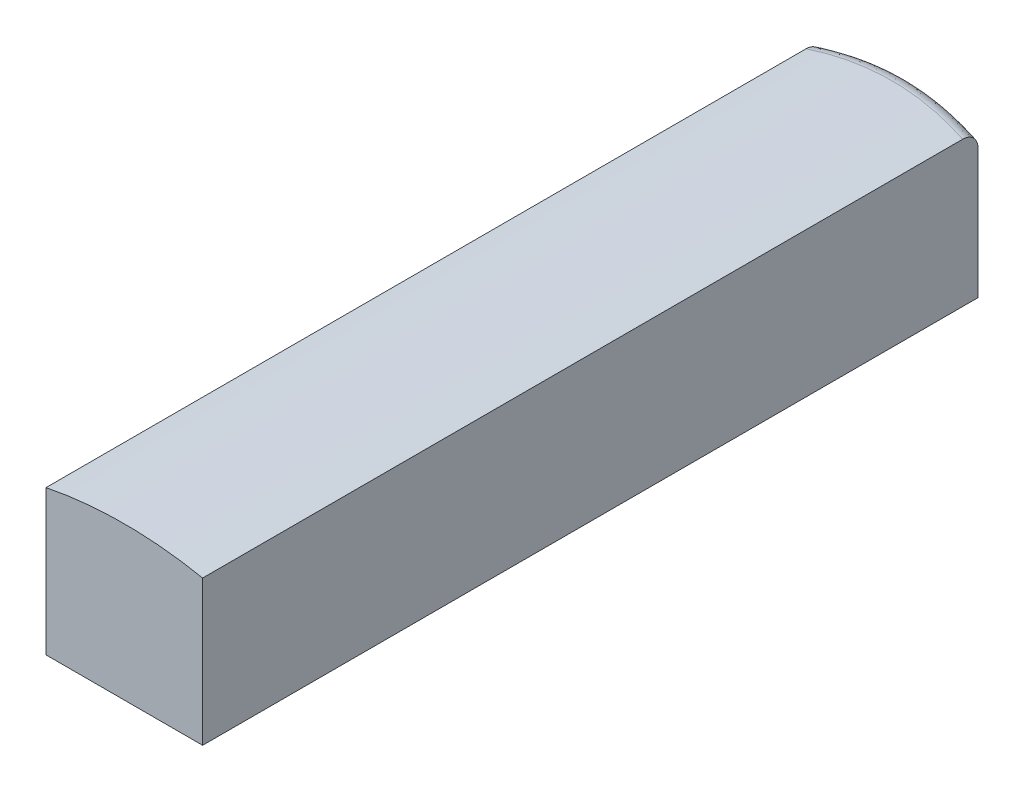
ISO-10303-21;
HEADER;
FILE_DESCRIPTION(('STEP AP214'),'2;1');
FILE_NAME('part.step','',(''),(''),'','','');
FILE_SCHEMA(('AUTOMOTIVE_DESIGN { 1 0 10303 214 1 1 1 1 }'));
ENDSEC;
DATA;
#1=APPLICATION_CONTEXT('core data for automotive mechanical design processes');
#2=APPLICATION_PROTOCOL_DEFINITION('international standard','automotive_design',2000,#1);
#3=PRODUCT_CONTEXT('',#1,'mechanical');
#4=PRODUCT('Part','Part','',(#3));
#5=PRODUCT_RELATED_PRODUCT_CATEGORY('part','',(#4));
#6=PRODUCT_DEFINITION_FORMATION('','',#4);
#7=PRODUCT_DEFINITION_CONTEXT('part definition',#1,'design');
#8=PRODUCT_DEFINITION('design','',#6,#7);
#9=PRODUCT_DEFINITION_SHAPE('','',#8);
#10=(LENGTH_UNIT() NAMED_UNIT(*) SI_UNIT(.MILLI.,.METRE.));
#11=(NAMED_UNIT(*) PLANE_ANGLE_UNIT() SI_UNIT($,.RADIAN.));
#12=(NAMED_UNIT(*) SI_UNIT($,.STERADIAN.) SOLID_ANGLE_UNIT());
#13=UNCERTAINTY_MEASURE_WITH_UNIT(LENGTH_MEASURE(1.E-05),#10,'distance_accuracy_value','');
#14=(GEOMETRIC_REPRESENTATION_CONTEXT(3) GLOBAL_UNCERTAINTY_ASSIGNED_CONTEXT((#13)) GLOBAL_UNIT_ASSIGNED_CONTEXT((#10,
#11,#12)) REPRESENTATION_CONTEXT('',''));
#15=CARTESIAN_POINT('',(0.,0.,0.));
#16=DIRECTION('',(0.,0.,1.));
#17=DIRECTION('',(1.,0.,0.));
#18=AXIS2_PLACEMENT_3D('',#15,#16,#17);
#19=CARTESIAN_POINT('',(0.,-309.999999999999,0.));
#20=DIRECTION('',(0.,0.,-1.));
#21=DIRECTION('',(-1.,0.,0.));
#22=AXIS2_PLACEMENT_3D('',#19,#20,#21);
#23=PLANE('',#22);
#24=DIRECTION('',(1.,0.,0.));
#25=VECTOR('',#24,1.);
#26=CARTESIAN_POINT('',(-100.,0.,0.));
#27=LINE('',#26,#25);
#28=CARTESIAN_POINT('',(-100.,0.,0.));
#29=VERTEX_POINT('',#28);
#30=CARTESIAN_POINT('',(100.,0.,0.));
#31=VERTEX_POINT('',#30);
#32=EDGE_CURVE('E85',#29,#31,#27,.T.);
#33=ORIENTED_EDGE('',*,*,#32,.T.);
#34=DIRECTION('',(0.,1.,0.));
#35=VECTOR('',#34,1.);
#36=CARTESIAN_POINT('',(100.,0.,0.));
#37=LINE('',#36,#35);
#38=CARTESIAN_POINT('',(100.,185.,0.));
#39=VERTEX_POINT('',#38);
#40=EDGE_CURVE('E94',#31,#39,#37,.T.);
#41=ORIENTED_EDGE('',*,*,#40,.T.);
#42=CARTESIAN_POINT('',(0.,-309.999999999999,0.));
#43=DIRECTION('',(0.,0.,1.));
#44=DIRECTION('',(-1.,0.,0.));
#45=AXIS2_PLACEMENT_3D('',#42,#43,#44);
#46=CIRCLE('',#45,504.999999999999);
#47=CARTESIAN_POINT('',(-100.,185.,0.));
#48=VERTEX_POINT('',#47);
#49=EDGE_CURVE('E100',#39,#48,#46,.T.);
#50=ORIENTED_EDGE('',*,*,#49,.T.);
#51=DIRECTION('',(0.,-1.,0.));
#52=VECTOR('',#51,1.);
#53=CARTESIAN_POINT('',(-100.,185.,0.));
#54=LINE('',#53,#52);
#55=EDGE_CURVE('E91',#48,#29,#54,.T.);
#56=ORIENTED_EDGE('',*,*,#55,.T.);
#57=EDGE_LOOP('',(#33,#41,#50,#56));
#58=FACE_BOUND('',#57,.T.);
#59=ADVANCED_FACE('F31',(#58),#23,.F.);
#60=CARTESIAN_POINT('',(100.,0.,-1000.001));
#61=DIRECTION('',(1.,0.,0.));
#62=DIRECTION('',(0.,0.,-1.));
#63=AXIS2_PLACEMENT_3D('',#60,#61,#62);
#64=PLANE('',#63);
#65=DIRECTION('',(0.,-1.,0.));
#66=VECTOR('',#65,1.);
#67=CARTESIAN_POINT('',(100.,200.,-990.));
#68=LINE('',#67,#66);
#69=CARTESIAN_POINT('',(100.,0.,-990.));
#70=VERTEX_POINT('',#69);
#71=CARTESIAN_POINT('',(100.,165.39603960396,-990.));
#72=VERTEX_POINT('',#71);
#73=EDGE_CURVE('E111',#70,#72,#68,.F.);
#74=ORIENTED_EDGE('',*,*,#73,.T.);
#75=CARTESIAN_POINT('',(505.,-309.999999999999,-495.));
#76=CARTESIAN_POINT('',(505.,-309.999999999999,-495.));
#77=CARTESIAN_POINT('',(504.999999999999,-309.999999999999,-495.));
#78=CARTESIAN_POINT('',(504.999964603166,-304.717241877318,-500.500603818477));
#79=CARTESIAN_POINT('',(505.000059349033,-304.608315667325,-500.391684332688));
#80=CARTESIAN_POINT('',(504.999964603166,-304.499396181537,-500.282758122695));
#81=CARTESIAN_POINT('',(504.910127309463,-299.434492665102,-506.001198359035));
#82=CARTESIAN_POINT('',(504.913681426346,-299.215686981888,-505.784313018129));
#83=CARTESIAN_POINT('',(504.910127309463,-298.998801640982,-505.565507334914));
#84=CARTESIAN_POINT('',(504.550597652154,-288.871786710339,-516.999479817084));
#85=CARTESIAN_POINT('',(504.568333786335,-288.434845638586,-516.565154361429));
#86=CARTESIAN_POINT('',(504.550597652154,-288.000520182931,-516.128213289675));
#87=CARTESIAN_POINT('',(504.280904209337,-283.591829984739,-522.497166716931));
#88=CARTESIAN_POINT('',(504.309240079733,-283.044715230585,-521.955284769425));
#89=CARTESIAN_POINT('',(504.280904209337,-282.50283328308,-521.408170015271));
#90=CARTESIAN_POINT('',(503.561381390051,-273.037113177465,-533.487129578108));
#91=CARTESIAN_POINT('',(503.618161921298,-272.270976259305,-532.729023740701));
#92=CARTESIAN_POINT('',(503.561381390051,-271.512870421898,-531.962886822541));
#93=CARTESIAN_POINT('',(503.11153720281,-267.762353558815,-538.979405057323));
#94=CARTESIAN_POINT('',(503.185916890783,-266.885454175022,-538.114545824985));
#95=CARTESIAN_POINT('',(503.11153720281,-266.020594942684,-537.237646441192));
#96=CARTESIAN_POINT('',(502.031236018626,-257.221489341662,-549.954944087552));
#97=CARTESIAN_POINT('',(502.148201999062,-256.124093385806,-548.875906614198));
#98=CARTESIAN_POINT('',(502.031236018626,-255.045055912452,-547.778510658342));
#99=CARTESIAN_POINT('',(501.400779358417,-251.955384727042,-555.43820765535));
#100=CARTESIAN_POINT('',(501.542362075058,-250.746347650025,-554.253652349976));
#101=CARTESIAN_POINT('',(501.400779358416,-249.561792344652,-553.044615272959));
#102=CARTESIAN_POINT('',(499.2497910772,-236.263967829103,-571.776693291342));
#103=CARTESIAN_POINT('',(499.47429734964,-234.711758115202,-570.288241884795));
#104=CARTESIAN_POINT('',(499.249791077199,-233.223306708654,-568.736032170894));
#105=CARTESIAN_POINT('',(497.463458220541,-225.854828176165,-582.615075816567));
#106=CARTESIAN_POINT('',(497.755478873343,-224.072252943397,-580.927747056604));
#107=CARTESIAN_POINT('',(497.463458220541,-222.384924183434,-579.145171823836));
#108=CARTESIAN_POINT('',(493.170701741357,-205.105754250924,-604.219781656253));
#109=CARTESIAN_POINT('',(493.629382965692,-202.87010914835,-602.129890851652));
#110=CARTESIAN_POINT('',(493.170701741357,-200.78021834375,-599.894245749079));
#111=CARTESIAN_POINT('',(490.664294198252,-194.76581843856,-614.986106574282));
#112=CARTESIAN_POINT('',(491.216283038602,-192.29290073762,-612.70709926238));
#113=CARTESIAN_POINT('',(490.664294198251,-190.013893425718,-610.23418156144));
#114=CARTESIAN_POINT('',(484.968865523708,-174.352020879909,-636.241710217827));
#115=CARTESIAN_POINT('',(485.738546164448,-171.414268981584,-633.585731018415));
#116=CARTESIAN_POINT('',(484.968865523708,-168.758289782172,-630.64797912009));
#117=CARTESIAN_POINT('',(481.791974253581,-164.276602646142,-646.732609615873));
#118=CARTESIAN_POINT('',(482.677698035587,-161.09659085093,-643.903409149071));
#119=CARTESIAN_POINT('',(481.791974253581,-158.267390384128,-640.723397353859));
#120=CARTESIAN_POINT('',(474.718918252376,-144.242645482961,-667.592709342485));
#121=CARTESIAN_POINT('',(475.868624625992,-140.579524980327,-664.420475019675));
#122=CARTESIAN_POINT('',(474.718918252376,-137.407290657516,-660.75735451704));
#123=CARTESIAN_POINT('',(470.822756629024,-134.284106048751,-677.961910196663));
#124=CARTESIAN_POINT('',(472.110958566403,-130.367104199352,-674.632895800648));
#125=CARTESIAN_POINT('',(470.822756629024,-127.038089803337,-670.715893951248));
#126=CARTESIAN_POINT('',(462.400437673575,-114.75610806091,-698.295186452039));
#127=CARTESIAN_POINT('',(463.99447354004,-110.337740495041,-694.662259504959));
#128=CARTESIAN_POINT('',(462.400437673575,-106.70481354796,-690.243891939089));
#129=CARTESIAN_POINT('',(457.892132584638,-105.183104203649,-708.262953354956));
#130=CARTESIAN_POINT('',(459.64112101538,-100.503614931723,-704.496385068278));
#131=CARTESIAN_POINT('',(457.892132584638,-96.7370466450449,-699.816895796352));
#132=CARTESIAN_POINT('',(448.159370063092,-86.2061475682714,-728.022464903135));
#133=CARTESIAN_POINT('',(450.247392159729,-80.9988131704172,-724.001186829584));
#134=CARTESIAN_POINT('',(448.159370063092,-76.9775350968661,-718.793852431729));
#135=CARTESIAN_POINT('',(442.934921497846,-76.8021926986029,-737.814211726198));
#136=CARTESIAN_POINT('',(445.194491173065,-71.3174949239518,-733.682505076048));
#137=CARTESIAN_POINT('',(442.934921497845,-67.1857882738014,-728.197807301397));
#138=CARTESIAN_POINT('',(431.928407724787,-58.4933556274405,-756.878052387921));
#139=CARTESIAN_POINT('',(434.554275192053,-52.4567042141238,-752.543295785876));
#140=CARTESIAN_POINT('',(431.928407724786,-48.1219476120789,-746.506644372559));
#141=CARTESIAN_POINT('',(426.169332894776,-49.5821097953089,-766.156772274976));
#142=CARTESIAN_POINT('',(428.973948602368,-43.2591098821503,-761.74089011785));
#143=CARTESIAN_POINT('',(426.169332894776,-38.8432277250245,-755.417890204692));
#144=CARTESIAN_POINT('',(413.942728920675,-31.9861534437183,-784.478335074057));
#145=CARTESIAN_POINT('',(417.126922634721,-25.0774650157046,-779.922534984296));
#146=CARTESIAN_POINT('',(413.942728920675,-20.5216649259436,-773.013846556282));
#147=CARTESIAN_POINT('',(407.475211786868,-23.3014390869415,-793.52118198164));
#148=CARTESIAN_POINT('',(410.845517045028,-16.086089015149,-788.91391098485));
#149=CARTESIAN_POINT('',(407.475211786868,-11.4788180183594,-781.698560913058));
#150=CARTESIAN_POINT('',(394.070679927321,-6.52416486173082,-810.990302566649));
#151=CARTESIAN_POINT('',(397.826393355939,1.30530398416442,-806.305303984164));
#152=CARTESIAN_POINT('',(394.07067992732,5.99030256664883,-798.475835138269));
#153=CARTESIAN_POINT('',(387.160762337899,1.57836194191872,-819.426954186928));
#154=CARTESIAN_POINT('',(391.097195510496,9.72406397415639,-814.724063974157));
#155=CARTESIAN_POINT('',(387.160762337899,14.4269541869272,-806.578361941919));
#156=CARTESIAN_POINT('',(372.648440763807,17.4928438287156,-835.997703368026));
#157=CARTESIAN_POINT('',(376.955513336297,26.2907131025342,-831.290713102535));
#158=CARTESIAN_POINT('',(372.648440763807,30.997703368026,-822.492843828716));
#159=CARTESIAN_POINT('',(365.046053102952,25.304805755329,-844.131808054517));
#160=CARTESIAN_POINT('',(369.527623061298,34.441675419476,-839.441675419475));
#161=CARTESIAN_POINT('',(365.046053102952,39.1318080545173,-830.304805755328));
#162=CARTESIAN_POINT('',(349.469942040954,40.2640182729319,-859.707895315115));
#163=CARTESIAN_POINT('',(354.29827024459,50.0821909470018,-855.082190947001));
#164=CARTESIAN_POINT('',(349.469942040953,54.7078953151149,-845.264018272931));
#165=CARTESIAN_POINT('',(341.525728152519,47.4254087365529,-867.164600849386));
#166=CARTESIAN_POINT('',(346.507188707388,57.5904228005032,-862.590422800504));
#167=CARTESIAN_POINT('',(341.525728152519,62.1646008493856,-852.425408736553));
#168=CARTESIAN_POINT('',(324.974515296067,61.3863780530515,-881.70128024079));
#169=CARTESIAN_POINT('',(330.251426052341,72.2687100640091,-877.268710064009));
#170=CARTESIAN_POINT('',(324.974515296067,76.7012802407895,-866.386378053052));
#171=CARTESIAN_POINT('',(316.367537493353,68.1859684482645,-888.781266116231));
#172=CARTESIAN_POINT('',(321.772912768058,79.4368073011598,-884.436807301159));
#173=CARTESIAN_POINT('',(316.367537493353,83.7812661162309,-873.185968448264));
#174=CARTESIAN_POINT('',(298.882265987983,81.0714383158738,-902.198095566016));
#175=CARTESIAN_POINT('',(304.52129178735,93.0619812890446,-898.061981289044));
#176=CARTESIAN_POINT('',(298.882265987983,97.1980955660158,-886.071438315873));
#177=CARTESIAN_POINT('',(290.033414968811,87.1756463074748,-908.55402347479));
#178=CARTESIAN_POINT('',(295.761208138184,99.5366714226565,-904.536671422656));
#179=CARTESIAN_POINT('',(290.03341496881,103.55402347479,-892.175646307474));
#180=CARTESIAN_POINT('',(276.301948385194,96.0017671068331,-917.744108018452));
#181=CARTESIAN_POINT('',(282.187103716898,108.898385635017,-913.898385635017));
#182=CARTESIAN_POINT('',(276.301948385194,112.744108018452,-901.001767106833));
#183=CARTESIAN_POINT('',(271.648017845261,98.88900406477,-920.750406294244));
#184=CARTESIAN_POINT('',(277.561860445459,111.977467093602,-916.977467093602));
#185=CARTESIAN_POINT('',(271.648017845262,115.750406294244,-903.88900406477));
#186=CARTESIAN_POINT('',(262.187882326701,104.545863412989,-926.640538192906));
#187=CARTESIAN_POINT('',(268.146372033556,118.02213233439,-923.02213233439));
#188=CARTESIAN_POINT('',(262.187882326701,121.640538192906,-909.545863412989));
#189=CARTESIAN_POINT('',(257.381690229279,107.315495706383,-929.524382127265));
#190=CARTESIAN_POINT('',(263.355187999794,120.986626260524,-925.986626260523));
#191=CARTESIAN_POINT('',(257.381690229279,124.524382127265,-912.315495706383));
#192=CARTESIAN_POINT('',(247.832681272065,112.610280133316,-935.037508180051));
#193=CARTESIAN_POINT('',(253.822779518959,126.664818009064,-931.664818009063));
#194=CARTESIAN_POINT('',(247.832681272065,130.037508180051,-917.610280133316));
#195=CARTESIAN_POINT('',(243.096349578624,115.1408272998,-937.67240780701));
#196=CARTESIAN_POINT('',(249.086422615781,129.383569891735,-934.383569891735));
#197=CARTESIAN_POINT('',(243.096349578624,132.67240780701,-920.1408272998));
#198=CARTESIAN_POINT('',(233.487827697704,120.079589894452,-942.814830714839));
#199=CARTESIAN_POINT('',(239.462557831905,134.700779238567,-939.700779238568));
#200=CARTESIAN_POINT('',(233.487827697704,137.814830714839,-925.079589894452));
#201=CARTESIAN_POINT('',(228.615649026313,122.487815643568,-945.322364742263));
#202=CARTESIAN_POINT('',(234.574689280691,137.297945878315,-942.297945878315));
#203=CARTESIAN_POINT('',(228.615649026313,140.322364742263,-927.487815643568));
#204=CARTESIAN_POINT('',(218.737606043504,127.17456394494,-950.202381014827));
#205=CARTESIAN_POINT('',(224.64818140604,142.363479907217,-947.363479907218));
#206=CARTESIAN_POINT('',(218.737606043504,145.202381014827,-932.17456394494));
#207=CARTESIAN_POINT('',(213.731739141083,129.453083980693,-952.57486063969));
#208=CARTESIAN_POINT('',(219.609465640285,144.83038132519,-949.83038132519));
#209=CARTESIAN_POINT('',(213.731739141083,147.57486063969,-934.453083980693));
#210=CARTESIAN_POINT('',(203.589897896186,133.872525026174,-957.176546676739));
#211=CARTESIAN_POINT('',(209.383115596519,149.62608424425,-954.62608424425));
#212=CARTESIAN_POINT('',(203.589897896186,152.176546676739,-938.872525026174));
#213=CARTESIAN_POINT('',(198.453924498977,136.013447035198,-959.405754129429));
#214=CARTESIAN_POINT('',(204.195754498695,151.953274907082,-956.953274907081));
#215=CARTESIAN_POINT('',(198.453924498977,154.405754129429,-941.013447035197));
#216=CARTESIAN_POINT('',(188.259991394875,140.068686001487,-963.628219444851));
#217=CARTESIAN_POINT('',(193.882445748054,156.371035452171,-961.37103545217));
#218=CARTESIAN_POINT('',(188.259991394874,158.628219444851,-945.068686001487));
#219=CARTESIAN_POINT('',(183.206856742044,141.988594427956,-965.627299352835));
#220=CARTESIAN_POINT('',(188.761325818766,158.466297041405,-963.466297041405));
#221=CARTESIAN_POINT('',(183.206856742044,160.627299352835,-946.988594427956));
#222=CARTESIAN_POINT('',(172.989532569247,145.686845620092,-969.478055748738));
#223=CARTESIAN_POINT('',(178.38801484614,162.511481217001,-967.511481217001));
#224=CARTESIAN_POINT('',(172.989532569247,164.478055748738,-950.686845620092));
#225=CARTESIAN_POINT('',(167.825345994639,147.465192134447,-971.32973613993));
#226=CARTESIAN_POINT('',(173.136802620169,164.459772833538,-969.459772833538));
#227=CARTESIAN_POINT('',(167.825345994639,166.32973613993,-952.465192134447));
#228=CARTESIAN_POINT('',(157.391699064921,150.873251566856,-974.878334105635));
#229=CARTESIAN_POINT('',(162.50816807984,168.202027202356,-973.202027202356));
#230=CARTESIAN_POINT('',(157.391699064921,169.878334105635,-955.873251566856));
#231=CARTESIAN_POINT('',(152.122240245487,152.502966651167,-976.575253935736));
#232=CARTESIAN_POINT('',(157.132141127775,169.994296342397,-974.994296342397));
#233=CARTESIAN_POINT('',(152.122240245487,171.575253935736,-957.502966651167));
#234=CARTESIAN_POINT('',(141.484822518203,155.606838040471,-979.807120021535));
#235=CARTESIAN_POINT('',(146.260085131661,173.415474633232,-978.415474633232));
#236=CARTESIAN_POINT('',(141.484822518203,174.807120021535,-960.606838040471));
#237=CARTESIAN_POINT('',(136.116864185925,157.08099525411,-981.342067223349));
#238=CARTESIAN_POINT('',(140.765897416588,175.04266365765,-980.04266365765));
#239=CARTESIAN_POINT('',(136.116864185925,176.342067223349,-962.080995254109));
#240=CARTESIAN_POINT('',(125.451984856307,159.825467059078,-984.199713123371));
#241=CARTESIAN_POINT('',(129.831864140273,178.078491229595,-983.078491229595));
#242=CARTESIAN_POINT('',(125.451984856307,179.199713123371,-964.825467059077));
#243=CARTESIAN_POINT('',(120.157727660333,161.100553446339,-985.527380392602));
#244=CARTESIAN_POINT('',(124.396608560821,179.490852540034,-984.490852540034));
#245=CARTESIAN_POINT('',(120.157727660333,180.527380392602,-966.100553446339));
#246=CARTESIAN_POINT('',(109.492101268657,163.492261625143,-988.017715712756));
#247=CARTESIAN_POINT('',(113.429028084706,182.145472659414,-987.145472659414));
#248=CARTESIAN_POINT('',(109.492101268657,183.017715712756,-968.492261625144));
#249=CARTESIAN_POINT('',(104.120732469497,164.608884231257,-989.180384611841));
#250=CARTESIAN_POINT('',(107.899228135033,183.386233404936,-988.386233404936));
#251=CARTESIAN_POINT('',(104.120732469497,184.180384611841,-969.608884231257));
#252=CARTESIAN_POINT('',(93.310076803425,166.678337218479,-991.335175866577));
#253=CARTESIAN_POINT('',(96.7526067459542,185.690188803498,-990.690188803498));
#254=CARTESIAN_POINT('',(93.3100768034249,186.335175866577,-971.678337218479));
#255=CARTESIAN_POINT('',(87.8707914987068,167.631171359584,-992.327302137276));
#256=CARTESIAN_POINT('',(91.1387206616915,186.751989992,-991.751989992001));
#257=CARTESIAN_POINT('',(87.8707914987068,187.327302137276,-972.631171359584));
#258=CARTESIAN_POINT('',(76.9341338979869,169.368345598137,-994.136112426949));
#259=CARTESIAN_POINT('',(79.8351269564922,188.691267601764,-993.691267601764));
#260=CARTESIAN_POINT('',(76.9341338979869,189.136112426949,-974.368345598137));
#261=CARTESIAN_POINT('',(71.4367617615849,170.152686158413,-994.952796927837));
#262=CARTESIAN_POINT('',(74.1487380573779,189.567493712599,-994.567493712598));
#263=CARTESIAN_POINT('',(71.4367617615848,189.952796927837,-975.152686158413));
#264=CARTESIAN_POINT('',(60.484692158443,171.537449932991,-996.394664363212));
#265=CARTESIAN_POINT('',(62.8062651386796,191.116904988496,-996.116904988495));
#266=CARTESIAN_POINT('',(60.4846921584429,191.394664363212,-976.53744993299));
#267=CARTESIAN_POINT('',(55.0307598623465,172.140662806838,-997.022751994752));
#268=CARTESIAN_POINT('',(57.1544578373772,191.792184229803,-996.792184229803));
#269=CARTESIAN_POINT('',(55.0307598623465,192.022751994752,-977.140662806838));
#270=CARTESIAN_POINT('',(44.0879509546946,173.17703172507,-998.101857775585));
#271=CARTESIAN_POINT('',(45.8029008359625,192.953928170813,-997.953928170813));
#272=CARTESIAN_POINT('',(44.0879509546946,193.101857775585,-978.17703172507));
#273=CARTESIAN_POINT('',(38.599074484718,173.610188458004,-998.55287664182));
#274=CARTESIAN_POINT('',(40.1069062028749,193.439600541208,-998.439600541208));
#275=CARTESIAN_POINT('',(38.599074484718,193.552876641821,-978.610188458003));
#276=CARTESIAN_POINT('',(27.5977785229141,174.304164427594,-999.275470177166));
#277=CARTESIAN_POINT('',(28.6810550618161,194.218575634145,-999.218575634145));
#278=CARTESIAN_POINT('',(27.5977785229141,194.275470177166,-979.304164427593));
#279=CARTESIAN_POINT('',(22.0853592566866,174.564985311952,-999.547046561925));
#280=CARTESIAN_POINT('',(22.9551565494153,194.511333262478,-999.511333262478));
#281=CARTESIAN_POINT('',(22.0853592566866,194.547046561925,-979.564985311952));
#282=CARTESIAN_POINT('',(11.048626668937,174.912903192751,-999.909311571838));
#283=CARTESIAN_POINT('',(11.484137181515,194.902185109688,-999.902185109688));
#284=CARTESIAN_POINT('',(11.048626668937,194.909311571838,-979.912903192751));
#285=CARTESIAN_POINT('',(5.52431333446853,175.,-1000.));
#286=CARTESIAN_POINT('',(5.74310031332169,195.,-999.999999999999));
#287=CARTESIAN_POINT('',(5.52431333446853,195.,-980.));
#288=CARTESIAN_POINT('',(-5.5243133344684,175.,-1000.));
#289=CARTESIAN_POINT('',(-5.74310031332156,195.,-999.999999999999));
#290=CARTESIAN_POINT('',(-5.5243133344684,195.,-980.));
#291=CARTESIAN_POINT('',(-11.0486266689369,174.912903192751,-999.909311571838));
#292=CARTESIAN_POINT('',(-11.4841371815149,194.902185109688,-999.902185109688));
#293=CARTESIAN_POINT('',(-11.0486266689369,194.909311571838,-979.912903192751));
#294=CARTESIAN_POINT('',(-22.0853592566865,174.564985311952,-999.547046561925));
#295=CARTESIAN_POINT('',(-22.9551565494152,194.511333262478,-999.511333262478));
#296=CARTESIAN_POINT('',(-22.0853592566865,194.547046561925,-979.564985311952));
#297=CARTESIAN_POINT('',(-27.597778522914,174.304164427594,-999.275470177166));
#298=CARTESIAN_POINT('',(-28.681055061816,194.218575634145,-999.218575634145));
#299=CARTESIAN_POINT('',(-27.597778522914,194.275470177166,-979.304164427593));
#300=CARTESIAN_POINT('',(-38.5990744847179,173.610188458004,-998.552876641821));
#301=CARTESIAN_POINT('',(-40.1069062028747,193.439600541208,-998.439600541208));
#302=CARTESIAN_POINT('',(-38.5990744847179,193.552876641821,-978.610188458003));
#303=CARTESIAN_POINT('',(-44.0879509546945,173.17703172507,-998.101857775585));
#304=CARTESIAN_POINT('',(-45.8029008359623,192.953928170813,-997.953928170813));
#305=CARTESIAN_POINT('',(-44.0879509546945,193.101857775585,-978.17703172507));
#306=CARTESIAN_POINT('',(-55.0307598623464,172.140662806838,-997.022751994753));
#307=CARTESIAN_POINT('',(-57.154457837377,191.792184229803,-996.792184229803));
#308=CARTESIAN_POINT('',(-55.0307598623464,192.022751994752,-977.140662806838));
#309=CARTESIAN_POINT('',(-60.4846921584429,171.537449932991,-996.394664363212));
#310=CARTESIAN_POINT('',(-62.8062651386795,191.116904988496,-996.116904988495));
#311=CARTESIAN_POINT('',(-60.4846921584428,191.394664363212,-976.53744993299));
#312=CARTESIAN_POINT('',(-71.4367617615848,170.152686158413,-994.952796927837));
#313=CARTESIAN_POINT('',(-74.1487380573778,189.567493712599,-994.567493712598));
#314=CARTESIAN_POINT('',(-71.4367617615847,189.952796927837,-975.152686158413));
#315=CARTESIAN_POINT('',(-76.9341338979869,169.368345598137,-994.136112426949));
#316=CARTESIAN_POINT('',(-79.8351269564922,188.691267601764,-993.691267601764));
#317=CARTESIAN_POINT('',(-76.9341338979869,189.136112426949,-974.368345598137));
#318=CARTESIAN_POINT('',(-87.8707914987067,167.631171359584,-992.327302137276));
#319=CARTESIAN_POINT('',(-91.1387206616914,186.751989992,-991.751989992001));
#320=CARTESIAN_POINT('',(-87.8707914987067,187.327302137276,-972.631171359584));
#321=CARTESIAN_POINT('',(-93.3100768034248,166.678337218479,-991.335175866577));
#322=CARTESIAN_POINT('',(-96.7526067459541,185.690188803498,-990.690188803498));
#323=CARTESIAN_POINT('',(-93.3100768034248,186.335175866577,-971.678337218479));
#324=CARTESIAN_POINT('',(-104.120732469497,164.608884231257,-989.180384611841));
#325=CARTESIAN_POINT('',(-107.899228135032,183.386233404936,-988.386233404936));
#326=CARTESIAN_POINT('',(-104.120732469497,184.180384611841,-969.608884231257));
#327=CARTESIAN_POINT('',(-109.492101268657,163.492261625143,-988.017715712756));
#328=CARTESIAN_POINT('',(-113.429028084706,182.145472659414,-987.145472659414));
#329=CARTESIAN_POINT('',(-109.492101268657,183.017715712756,-968.492261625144));
#330=CARTESIAN_POINT('',(-120.157727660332,161.100553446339,-985.527380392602));
#331=CARTESIAN_POINT('',(-124.39660856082,179.490852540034,-984.490852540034));
#332=CARTESIAN_POINT('',(-120.157727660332,180.527380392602,-966.100553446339));
#333=CARTESIAN_POINT('',(-125.451984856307,159.825467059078,-984.199713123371));
#334=CARTESIAN_POINT('',(-129.831864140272,178.078491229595,-983.078491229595));
#335=CARTESIAN_POINT('',(-125.451984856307,179.199713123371,-964.825467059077));
#336=CARTESIAN_POINT('',(-136.116864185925,157.08099525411,-981.342067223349));
#337=CARTESIAN_POINT('',(-140.765897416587,175.04266365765,-980.04266365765));
#338=CARTESIAN_POINT('',(-136.116864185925,176.342067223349,-962.080995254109));
#339=CARTESIAN_POINT('',(-141.484822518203,155.606838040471,-979.807120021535));
#340=CARTESIAN_POINT('',(-146.260085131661,173.415474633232,-978.415474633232));
#341=CARTESIAN_POINT('',(-141.484822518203,174.807120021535,-960.606838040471));
#342=CARTESIAN_POINT('',(-152.122240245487,152.502966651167,-976.575253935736));
#343=CARTESIAN_POINT('',(-157.132141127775,169.994296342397,-974.994296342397));
#344=CARTESIAN_POINT('',(-152.122240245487,171.575253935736,-957.502966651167));
#345=CARTESIAN_POINT('',(-157.391699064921,150.873251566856,-974.878334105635));
#346=CARTESIAN_POINT('',(-162.50816807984,168.202027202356,-973.202027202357));
#347=CARTESIAN_POINT('',(-157.391699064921,169.878334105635,-955.873251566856));
#348=CARTESIAN_POINT('',(-167.825345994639,147.465192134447,-971.32973613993));
#349=CARTESIAN_POINT('',(-173.136802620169,164.459772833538,-969.459772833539));
#350=CARTESIAN_POINT('',(-167.825345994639,166.32973613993,-952.465192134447));
#351=CARTESIAN_POINT('',(-172.989532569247,145.686845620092,-969.478055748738));
#352=CARTESIAN_POINT('',(-178.38801484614,162.511481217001,-967.511481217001));
#353=CARTESIAN_POINT('',(-172.989532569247,164.478055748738,-950.686845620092));
#354=CARTESIAN_POINT('',(-183.206856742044,141.988594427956,-965.627299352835));
#355=CARTESIAN_POINT('',(-188.761325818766,158.466297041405,-963.466297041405));
#356=CARTESIAN_POINT('',(-183.206856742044,160.627299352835,-946.988594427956));
#357=CARTESIAN_POINT('',(-188.259991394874,140.068686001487,-963.628219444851));
#358=CARTESIAN_POINT('',(-193.882445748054,156.371035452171,-961.37103545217));
#359=CARTESIAN_POINT('',(-188.259991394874,158.628219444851,-945.068686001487));
#360=CARTESIAN_POINT('',(-198.453924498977,136.013447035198,-959.405754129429));
#361=CARTESIAN_POINT('',(-204.195754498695,151.953274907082,-956.953274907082));
#362=CARTESIAN_POINT('',(-198.453924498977,154.405754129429,-941.013447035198));
#363=CARTESIAN_POINT('',(-203.589897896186,133.872525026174,-957.176546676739));
#364=CARTESIAN_POINT('',(-209.383115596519,149.62608424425,-954.62608424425));
#365=CARTESIAN_POINT('',(-203.589897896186,152.176546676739,-938.872525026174));
#366=CARTESIAN_POINT('',(-213.731739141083,129.453083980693,-952.57486063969));
#367=CARTESIAN_POINT('',(-219.609465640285,144.83038132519,-949.83038132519));
#368=CARTESIAN_POINT('',(-213.731739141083,147.57486063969,-934.453083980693));
#369=CARTESIAN_POINT('',(-218.737606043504,127.17456394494,-950.202381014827));
#370=CARTESIAN_POINT('',(-224.64818140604,142.363479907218,-947.363479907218));
#371=CARTESIAN_POINT('',(-218.737606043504,145.202381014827,-932.17456394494));
#372=CARTESIAN_POINT('',(-228.615649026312,122.487815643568,-945.322364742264));
#373=CARTESIAN_POINT('',(-234.574689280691,137.297945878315,-942.297945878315));
#374=CARTESIAN_POINT('',(-228.615649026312,140.322364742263,-927.487815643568));
#375=CARTESIAN_POINT('',(-233.487827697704,120.079589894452,-942.814830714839));
#376=CARTESIAN_POINT('',(-239.462557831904,134.700779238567,-939.700779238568));
#377=CARTESIAN_POINT('',(-233.487827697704,137.814830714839,-925.079589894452));
#378=CARTESIAN_POINT('',(-243.096349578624,115.1408272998,-937.67240780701));
#379=CARTESIAN_POINT('',(-249.086422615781,129.383569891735,-934.383569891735));
#380=CARTESIAN_POINT('',(-243.096349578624,132.67240780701,-920.1408272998));
#381=CARTESIAN_POINT('',(-247.832681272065,112.610280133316,-935.037508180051));
#382=CARTESIAN_POINT('',(-253.822779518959,126.664818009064,-931.664818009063));
#383=CARTESIAN_POINT('',(-247.832681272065,130.037508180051,-917.610280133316));
#384=CARTESIAN_POINT('',(-257.381690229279,107.315495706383,-929.524382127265));
#385=CARTESIAN_POINT('',(-263.355187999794,120.986626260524,-925.986626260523));
#386=CARTESIAN_POINT('',(-257.381690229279,124.524382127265,-912.315495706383));
#387=CARTESIAN_POINT('',(-262.187882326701,104.545863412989,-926.640538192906));
#388=CARTESIAN_POINT('',(-268.146372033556,118.02213233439,-923.02213233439));
#389=CARTESIAN_POINT('',(-262.187882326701,121.640538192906,-909.545863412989));
#390=CARTESIAN_POINT('',(-271.648017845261,98.88900406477,-920.750406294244));
#391=CARTESIAN_POINT('',(-277.561860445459,111.977467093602,-916.977467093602));
#392=CARTESIAN_POINT('',(-271.648017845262,115.750406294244,-903.88900406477));
#393=CARTESIAN_POINT('',(-276.301948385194,96.001767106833,-917.744108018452));
#394=CARTESIAN_POINT('',(-282.187103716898,108.898385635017,-913.898385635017));
#395=CARTESIAN_POINT('',(-276.301948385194,112.744108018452,-901.001767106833));
#396=CARTESIAN_POINT('',(-290.033414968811,87.1756463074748,-908.55402347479));
#397=CARTESIAN_POINT('',(-295.761208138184,99.5366714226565,-904.536671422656));
#398=CARTESIAN_POINT('',(-290.03341496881,103.55402347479,-892.175646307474));
#399=CARTESIAN_POINT('',(-298.882265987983,81.0714383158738,-902.198095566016));
#400=CARTESIAN_POINT('',(-304.52129178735,93.0619812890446,-898.061981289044));
#401=CARTESIAN_POINT('',(-298.882265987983,97.1980955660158,-886.071438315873));
#402=CARTESIAN_POINT('',(-316.367537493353,68.1859684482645,-888.781266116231));
#403=CARTESIAN_POINT('',(-321.772912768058,79.4368073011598,-884.436807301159));
#404=CARTESIAN_POINT('',(-316.367537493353,83.7812661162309,-873.185968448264));
#405=CARTESIAN_POINT('',(-324.974515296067,61.3863780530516,-881.70128024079));
#406=CARTESIAN_POINT('',(-330.251426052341,72.2687100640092,-877.268710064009));
#407=CARTESIAN_POINT('',(-324.974515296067,76.7012802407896,-866.386378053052));
#408=CARTESIAN_POINT('',(-341.525728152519,47.4254087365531,-867.164600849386));
#409=CARTESIAN_POINT('',(-346.507188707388,57.5904228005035,-862.590422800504));
#410=CARTESIAN_POINT('',(-341.525728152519,62.1646008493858,-852.425408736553));
#411=CARTESIAN_POINT('',(-349.469942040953,40.2640182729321,-859.707895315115));
#412=CARTESIAN_POINT('',(-354.298270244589,50.082190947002,-855.082190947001));
#413=CARTESIAN_POINT('',(-349.469942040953,54.7078953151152,-845.264018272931));
#414=CARTESIAN_POINT('',(-365.046053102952,25.3048057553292,-844.131808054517));
#415=CARTESIAN_POINT('',(-369.527623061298,34.4416754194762,-839.441675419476));
#416=CARTESIAN_POINT('',(-365.046053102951,39.1318080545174,-830.304805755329));
#417=CARTESIAN_POINT('',(-372.648440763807,17.4928438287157,-835.997703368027));
#418=CARTESIAN_POINT('',(-376.955513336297,26.2907131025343,-831.290713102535));
#419=CARTESIAN_POINT('',(-372.648440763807,30.9977033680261,-822.492843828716));
#420=CARTESIAN_POINT('',(-387.160762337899,1.5783619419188,-819.426954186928));
#421=CARTESIAN_POINT('',(-391.097195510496,9.72406397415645,-814.724063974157));
#422=CARTESIAN_POINT('',(-387.160762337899,14.4269541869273,-806.578361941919));
#423=CARTESIAN_POINT('',(-394.070679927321,-6.52416486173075,-810.990302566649));
#424=CARTESIAN_POINT('',(-397.826393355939,1.30530398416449,-806.305303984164));
#425=CARTESIAN_POINT('',(-394.07067992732,5.99030256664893,-798.475835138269));
#426=CARTESIAN_POINT('',(-407.475211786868,-23.3014390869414,-793.521181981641));
#427=CARTESIAN_POINT('',(-410.845517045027,-16.0860890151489,-788.913910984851));
#428=CARTESIAN_POINT('',(-407.475211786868,-11.4788180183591,-781.698560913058));
#429=CARTESIAN_POINT('',(-413.942728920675,-31.9861534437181,-784.478335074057));
#430=CARTESIAN_POINT('',(-417.126922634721,-25.0774650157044,-779.922534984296));
#431=CARTESIAN_POINT('',(-413.942728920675,-20.5216649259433,-773.013846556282));
#432=CARTESIAN_POINT('',(-426.169332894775,-49.5821097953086,-766.156772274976));
#433=CARTESIAN_POINT('',(-428.973948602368,-43.25910988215,-761.740890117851));
#434=CARTESIAN_POINT('',(-426.169332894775,-38.8432277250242,-755.417890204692));
#435=CARTESIAN_POINT('',(-431.928407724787,-58.4933556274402,-756.878052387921));
#436=CARTESIAN_POINT('',(-434.554275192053,-52.4567042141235,-752.543295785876));
#437=CARTESIAN_POINT('',(-431.928407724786,-48.1219476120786,-746.506644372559));
#438=CARTESIAN_POINT('',(-442.934921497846,-76.8021926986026,-737.814211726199));
#439=CARTESIAN_POINT('',(-445.194491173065,-71.3174949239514,-733.682505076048));
#440=CARTESIAN_POINT('',(-442.934921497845,-67.1857882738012,-728.197807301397));
#441=CARTESIAN_POINT('',(-448.159370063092,-86.206147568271,-728.022464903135));
#442=CARTESIAN_POINT('',(-450.247392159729,-80.9988131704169,-724.001186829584));
#443=CARTESIAN_POINT('',(-448.159370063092,-76.9775350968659,-718.79385243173));
#444=CARTESIAN_POINT('',(-457.892132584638,-105.183104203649,-708.262953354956));
#445=CARTESIAN_POINT('',(-459.64112101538,-100.503614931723,-704.496385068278));
#446=CARTESIAN_POINT('',(-457.892132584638,-96.7370466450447,-699.816895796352));
#447=CARTESIAN_POINT('',(-462.400437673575,-114.75610806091,-698.295186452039));
#448=CARTESIAN_POINT('',(-463.99447354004,-110.337740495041,-694.662259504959));
#449=CARTESIAN_POINT('',(-462.400437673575,-106.70481354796,-690.243891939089));
#450=CARTESIAN_POINT('',(-470.822756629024,-134.284106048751,-677.961910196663));
#451=CARTESIAN_POINT('',(-472.110958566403,-130.367104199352,-674.632895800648));
#452=CARTESIAN_POINT('',(-470.822756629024,-127.038089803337,-670.715893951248));
#453=CARTESIAN_POINT('',(-474.718918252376,-144.242645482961,-667.592709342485));
#454=CARTESIAN_POINT('',(-475.868624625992,-140.579524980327,-664.420475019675));
#455=CARTESIAN_POINT('',(-474.718918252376,-137.407290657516,-660.75735451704));
#456=CARTESIAN_POINT('',(-481.791974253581,-164.276602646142,-646.732609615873));
#457=CARTESIAN_POINT('',(-482.677698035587,-161.09659085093,-643.903409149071));
#458=CARTESIAN_POINT('',(-481.791974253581,-158.267390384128,-640.723397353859));
#459=CARTESIAN_POINT('',(-484.968865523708,-174.352020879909,-636.241710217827));
#460=CARTESIAN_POINT('',(-485.738546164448,-171.414268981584,-633.585731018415));
#461=CARTESIAN_POINT('',(-484.968865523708,-168.758289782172,-630.64797912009));
#462=CARTESIAN_POINT('',(-490.664294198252,-194.76581843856,-614.986106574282));
#463=CARTESIAN_POINT('',(-491.216283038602,-192.29290073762,-612.70709926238));
#464=CARTESIAN_POINT('',(-490.664294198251,-190.013893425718,-610.23418156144));
#465=CARTESIAN_POINT('',(-493.170701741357,-205.105754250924,-604.219781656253));
#466=CARTESIAN_POINT('',(-493.629382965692,-202.87010914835,-602.129890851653));
#467=CARTESIAN_POINT('',(-493.170701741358,-200.78021834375,-599.894245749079));
#468=CARTESIAN_POINT('',(-497.463458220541,-225.854828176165,-582.615075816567));
#469=CARTESIAN_POINT('',(-497.755478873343,-224.072252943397,-580.927747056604));
#470=CARTESIAN_POINT('',(-497.463458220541,-222.384924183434,-579.145171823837));
#471=CARTESIAN_POINT('',(-499.2497910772,-236.263967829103,-571.776693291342));
#472=CARTESIAN_POINT('',(-499.47429734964,-234.711758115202,-570.288241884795));
#473=CARTESIAN_POINT('',(-499.249791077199,-233.223306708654,-568.736032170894));
#474=CARTESIAN_POINT('',(-501.400779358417,-251.955384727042,-555.438207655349));
#475=CARTESIAN_POINT('',(-501.542362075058,-250.746347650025,-554.253652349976));
#476=CARTESIAN_POINT('',(-501.400779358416,-249.561792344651,-553.044615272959));
#477=CARTESIAN_POINT('',(-502.031236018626,-257.221489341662,-549.954944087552));
#478=CARTESIAN_POINT('',(-502.148201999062,-256.124093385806,-548.875906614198));
#479=CARTESIAN_POINT('',(-502.031236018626,-255.045055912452,-547.778510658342));
#480=CARTESIAN_POINT('',(-503.11153720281,-267.762353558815,-538.979405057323));
#481=CARTESIAN_POINT('',(-503.185916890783,-266.885454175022,-538.114545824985));
#482=CARTESIAN_POINT('',(-503.11153720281,-266.020594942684,-537.237646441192));
#483=CARTESIAN_POINT('',(-503.561381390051,-273.037113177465,-533.487129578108));
#484=CARTESIAN_POINT('',(-503.618161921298,-272.270976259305,-532.729023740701));
#485=CARTESIAN_POINT('',(-503.561381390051,-271.512870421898,-531.962886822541));
#486=CARTESIAN_POINT('',(-504.280904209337,-283.591829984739,-522.497166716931));
#487=CARTESIAN_POINT('',(-504.309240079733,-283.044715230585,-521.955284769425));
#488=CARTESIAN_POINT('',(-504.280904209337,-282.50283328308,-521.408170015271));
#489=CARTESIAN_POINT('',(-504.550597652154,-288.871786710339,-516.999479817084));
#490=CARTESIAN_POINT('',(-504.568333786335,-288.434845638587,-516.565154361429));
#491=CARTESIAN_POINT('',(-504.550597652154,-288.000520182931,-516.128213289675));
#492=CARTESIAN_POINT('',(-504.910127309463,-299.434492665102,-506.001198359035));
#493=CARTESIAN_POINT('',(-504.913681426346,-299.215686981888,-505.784313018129));
#494=CARTESIAN_POINT('',(-504.910127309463,-298.998801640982,-505.565507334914));
#495=CARTESIAN_POINT('',(-504.999964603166,-304.717241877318,-500.500603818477));
#496=CARTESIAN_POINT('',(-505.000059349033,-304.608315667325,-500.391684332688));
#497=CARTESIAN_POINT('',(-504.999964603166,-304.499396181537,-500.282758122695));
#498=CARTESIAN_POINT('',(-505.,-309.999999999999,-495.));
#499=CARTESIAN_POINT('',(-505.,-309.999999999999,-495.));
#500=CARTESIAN_POINT('',(-504.999999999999,-309.999999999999,-495.));
#501=(BOUNDED_SURFACE() B_SPLINE_SURFACE(3,2,((#75,#76,#77),(#78,#79,#80),(#81,#82,#83),(#84,
#85,#86),(#87,#88,#89),(#90,#91,#92),(#93,#94,#95),(#96,#97,#98),(#99,#100,#101),(#102,#103,
#104),(#105,#106,#107),(#108,#109,#110),(#111,#112,#113),(#114,#115,#116),(#117,#118,#119),
(#120,#121,#122),(#123,#124,#125),(#126,#127,#128),(#129,#130,#131),(#132,#133,#134),(#135,#136,
#137),(#138,#139,#140),(#141,#142,#143),(#144,#145,#146),(#147,#148,#149),(#150,#151,#152),
(#153,#154,#155),(#156,#157,#158),(#159,#160,#161),(#162,#163,#164),(#165,#166,#167),(#168,#169,
#170),(#171,#172,#173),(#174,#175,#176),(#177,#178,#179),(#180,#181,#182),(#183,#184,#185),
(#186,#187,#188),(#189,#190,#191),(#192,#193,#194),(#195,#196,#197),(#198,#199,#200),(#201,#202,
#203),(#204,#205,#206),(#207,#208,#209),(#210,#211,#212),(#213,#214,#215),(#216,#217,#218),
(#219,#220,#221),(#222,#223,#224),(#225,#226,#227),(#228,#229,#230),(#231,#232,#233),(#234,#235,
#236),(#237,#238,#239),(#240,#241,#242),(#243,#244,#245),(#246,#247,#248),(#249,#250,#251),
(#252,#253,#254),(#255,#256,#257),(#258,#259,#260),(#261,#262,#263),(#264,#265,#266),(#267,#268,
#269),(#270,#271,#272),(#273,#274,#275),(#276,#277,#278),(#279,#280,#281),(#282,#283,#284),
(#285,#286,#287),(#288,#289,#290),(#291,#292,#293),(#294,#295,#296),(#297,#298,#299),(#300,#301,
#302),(#303,#304,#305),(#306,#307,#308),(#309,#310,#311),(#312,#313,#314),(#315,#316,#317),
(#318,#319,#320),(#321,#322,#323),(#324,#325,#326),(#327,#328,#329),(#330,#331,#332),(#333,#334,
#335),(#336,#337,#338),(#339,#340,#341),(#342,#343,#344),(#345,#346,#347),(#348,#349,#350),
(#351,#352,#353),(#354,#355,#356),(#357,#358,#359),(#360,#361,#362),(#363,#364,#365),(#366,#367,
#368),(#369,#370,#371),(#372,#373,#374),(#375,#376,#377),(#378,#379,#380),(#381,#382,#383),
(#384,#385,#386),(#387,#388,#389),(#390,#391,#392),(#393,#394,#395),(#396,#397,#398),(#399,#400,
#401),(#402,#403,#404),(#405,#406,#407),(#408,#409,#410),(#411,#412,#413),(#414,#415,#416),
(#417,#418,#419),(#420,#421,#422),(#423,#424,#425),(#426,#427,#428),(#429,#430,#431),(#432,#433,
#434),(#435,#436,#437),(#438,#439,#440),(#441,#442,#443),(#444,#445,#446),(#447,#448,#449),
(#450,#451,#452),(#453,#454,#455),(#456,#457,#458),(#459,#460,#461),(#462,#463,#464),(#465,#466,
#467),(#468,#469,#470),(#471,#472,#473),(#474,#475,#476),(#477,#478,#479),(#480,#481,#482),
(#483,#484,#485),(#486,#487,#488),(#489,#490,#491),(#492,#493,#494),(#495,#496,#497),(#498,#499,
#500)),.UNSPECIFIED.,.F.,.F.,.F.) B_SPLINE_SURFACE_WITH_KNOTS((4,2,2,2,2,2,2,2,2,2,2,2,2,2,2,2,
2,2,2,2,2,2,2,2,2,2,2,2,2,2,2,2,2,2,2,2,2,2,2,2,2,2,2,2,2,2,2,2,2,2,2,2,2,2,2,2,2,2,2,2,2,2,2,2,
2,2,2,2,2,2,4),(3,3),(0.,22.41231845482,44.8247713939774,67.2390673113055,89.6533214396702,
134.096880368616,178.539446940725,222.238013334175,265.936390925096,308.55997203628,
351.183025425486,392.451863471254,433.720001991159,473.423511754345,513.126085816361,
551.141459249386,589.155619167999,625.466264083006,643.624636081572,661.781475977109,
679.140987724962,696.499032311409,713.857413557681,731.215668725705,747.893959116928,
764.571807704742,781.249413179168,797.926921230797,814.106519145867,830.286033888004,
846.465177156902,862.644275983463,878.559635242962,894.474930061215,910.390072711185,
926.305232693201,942.220392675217,958.135535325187,974.05083014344,989.966189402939,
1006.1452882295,1022.3244314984,1038.50394624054,1054.6835441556,1071.36105220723,
1088.03865768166,1104.71650626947,1121.3947966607,1138.75305182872,1156.11143307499,
1173.46947766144,1190.82898940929,1208.98582930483,1227.1442013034,1263.4548462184,
1301.46900613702,1339.48437957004,1379.18695363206,1418.89046339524,1460.15860191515,
1501.42743996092,1544.05049335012,1586.67407446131,1630.37245205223,1674.07101844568,
1718.51358501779,1762.95714394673,1785.3713980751,1807.78569399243,1830.19814693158,
1852.6104653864),(0.,1.),
.UNSPECIFIED.) GEOMETRIC_REPRESENTATION_ITEM() RATIONAL_B_SPLINE_SURFACE(((1.,1.,1.),(1.,
1.00000001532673,1.),(1.,0.999911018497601,1.),(1.,0.999555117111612,1.),(1.,0.99928821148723,
1.),(1.,0.998576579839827,1.),(1.,0.998131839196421,1.),(1.,0.997064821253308,1.),(1.,
0.9964425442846,1.),(1.,0.994321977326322,1.),(1.,0.992563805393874,1.),(1.,0.988354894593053,
1.),(1.,0.985904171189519,1.),(1.,0.980363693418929,1.),(1.,0.977285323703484,1.),(1.,
0.970475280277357,1.),(1.,0.966743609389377,1.),(1.,0.958740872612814,1.),(1.,0.954485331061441,
1.),(1.,0.945385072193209,1.),(1.,0.94054036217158,1.),(1.,0.930451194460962,1.),(1.,
0.925224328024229,1.),(1.,0.914276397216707,1.),(1.,0.908555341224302,1.),(1.,0.896890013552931,
1.),(1.,0.890962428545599,1.),(1.,0.878746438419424,1.),(1.,0.872458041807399,1.),(1.,
0.85986612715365,1.),(1.,0.853574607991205,1.),(1.,0.84081002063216,1.),(1.,0.834336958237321,
1.),(1.,0.821606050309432,1.),(1.,0.815351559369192,1.),(1.,0.806006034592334,1.),(1.,
0.802896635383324,1.),(1.,0.796706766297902,1.),(1.,0.793626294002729,1.),(1.,0.787646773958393,
1.),(1.,0.784745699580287,1.),(1.,0.779004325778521,1.),(1.,0.776164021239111,1.),(1.,
0.770562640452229,1.),(1.,0.767801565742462,1.),(1.,0.762378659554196,1.),(1.,0.759716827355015,
1.),(1.,0.754615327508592,1.),(1.,0.752171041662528,1.),(1.,0.747412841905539,1.),(1.,
0.74509892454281,1.),(1.,0.74062118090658,1.),(1.,0.73845735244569,1.),(1.,0.734299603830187,
1.),(1.,0.732305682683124,1.),(1.,0.728564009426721,1.),(1.,0.726810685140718,1.),(1.,
0.723499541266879,1.),(1.,0.721941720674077,1.),(1.,0.719037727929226,1.),(1.,0.71769155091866,
1.),(1.,0.715225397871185,1.),(1.,0.714105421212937,1.),(1.,0.712120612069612,1.),(1.,
0.711251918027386,1.),(1.,0.70975542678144,1.),(1.,0.709127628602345,1.),(1.,0.708120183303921,
1.),(1.,0.707740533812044,1.),(1.,0.707233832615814,1.),(1.,0.707106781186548,1.),(1.,
0.707106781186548,1.),(1.,0.707233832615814,1.),(1.,0.707740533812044,1.),(1.,0.708120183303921,
1.),(1.,0.709127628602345,1.),(1.,0.70975542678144,1.),(1.,0.711251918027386,1.),(1.,
0.712120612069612,1.),(1.,0.714105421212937,1.),(1.,0.715225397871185,1.),(1.,0.71769155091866,
1.),(1.,0.719037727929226,1.),(1.,0.721941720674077,1.),(1.,0.723499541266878,1.),(1.,
0.726810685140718,1.),(1.,0.728564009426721,1.),(1.,0.732305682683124,1.),(1.,0.734299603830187,
1.),(1.,0.73845735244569,1.),(1.,0.74062118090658,1.),(1.,0.74509892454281,1.),(1.,
0.747412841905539,1.),(1.,0.752171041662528,1.),(1.,0.754615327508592,1.),(1.,0.759716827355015,
1.),(1.,0.762378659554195,1.),(1.,0.767801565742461,1.),(1.,0.770562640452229,1.),(1.,
0.776164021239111,1.),(1.,0.779004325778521,1.),(1.,0.784745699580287,1.),(1.,0.787646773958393,
1.),(1.,0.793626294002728,1.),(1.,0.796706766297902,1.),(1.,0.802896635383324,1.),(1.,
0.806006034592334,1.),(1.,0.815351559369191,1.),(1.,0.821606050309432,1.),(1.,0.834336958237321,
1.),(1.,0.84081002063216,1.),(1.,0.853574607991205,1.),(1.,0.85986612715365,1.),(1.,
0.872458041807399,1.),(1.,0.878746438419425,1.),(1.,0.890962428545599,1.),(1.,0.896890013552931,
1.),(1.,0.908555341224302,1.),(1.,0.914276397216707,1.),(1.,0.925224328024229,1.),(1.,
0.930451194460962,1.),(1.,0.94054036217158,1.),(1.,0.945385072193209,1.),(1.,0.954485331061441,
1.),(1.,0.958740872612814,1.),(1.,0.966743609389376,1.),(1.,0.970475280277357,1.),(1.,
0.977285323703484,1.),(1.,0.980363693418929,1.),(1.,0.985904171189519,1.),(1.,0.988354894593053,
1.),(1.,0.992563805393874,1.),(1.,0.994321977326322,1.),(1.,0.9964425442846,1.),(1.,
0.997064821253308,1.),(1.,0.998131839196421,1.),(1.,0.998576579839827,1.),(1.,0.99928821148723,
1.),(1.,0.999555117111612,1.),(1.,0.999911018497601,1.),(1.,1.00000001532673,1.),(1.,1.,1.))) REPRESENTATION_ITEM('') SURFACE());
#502=CARTESIAN_POINT('',(100.,165.39603960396,-990.));
#503=CARTESIAN_POINT('',(100.,165.674364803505,-990.000000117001));
#504=CARTESIAN_POINT('',(100.,165.952662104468,-989.994286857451));
#505=CARTESIAN_POINT('',(100.,166.50878351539,-989.971394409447));
#506=CARTESIAN_POINT('',(100.,166.786607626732,-989.954215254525));
#507=CARTESIAN_POINT('',(100.,167.618696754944,-989.885424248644));
#508=CARTESIAN_POINT('',(100.,168.171628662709,-989.816558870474));
#509=CARTESIAN_POINT('',(100.,169.269954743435,-989.632831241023));
#510=CARTESIAN_POINT('',(100.,169.815347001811,-989.517957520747));
#511=CARTESIAN_POINT('',(100.,170.624556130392,-989.311535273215));
#512=CARTESIAN_POINT('',(100.,170.892816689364,-989.23704117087));
#513=CARTESIAN_POINT('',(100.,171.426016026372,-989.076744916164));
#514=CARTESIAN_POINT('',(100.,171.690953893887,-988.990939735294));
#515=CARTESIAN_POINT('',(100.,172.480555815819,-988.716521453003));
#516=CARTESIAN_POINT('',(100.,172.999462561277,-988.511044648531));
#517=CARTESIAN_POINT('',(100.,174.0177706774,-988.056402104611));
#518=CARTESIAN_POINT('',(100.,174.517172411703,-987.807237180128));
#519=CARTESIAN_POINT('',(100.,175.248592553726,-987.402071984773));
#520=CARTESIAN_POINT('',(100.,175.489429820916,-987.261795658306));
#521=CARTESIAN_POINT('',(100.,175.964765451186,-986.971022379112));
#522=CARTESIAN_POINT('',(100.,176.199265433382,-986.820528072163));
#523=CARTESIAN_POINT('',(100.,176.892701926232,-986.354016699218));
#524=CARTESIAN_POINT('',(100.,177.341638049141,-986.02293624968));
#525=CARTESIAN_POINT('',(100.,178.200572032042,-985.330038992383));
#526=CARTESIAN_POINT('',(100.,178.611160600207,-984.968951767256));
#527=CARTESIAN_POINT('',(100.,179.400164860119,-984.213162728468));
#528=CARTESIAN_POINT('',(100.,179.778580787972,-983.818461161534));
#529=CARTESIAN_POINT('',(100.,180.500549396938,-982.998259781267));
#530=CARTESIAN_POINT('',(100.,180.844096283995,-982.572754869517));
#531=CARTESIAN_POINT('',(100.,181.493841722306,-981.694136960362));
#532=CARTESIAN_POINT('',(100.,181.800040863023,-981.241024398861));
#533=CARTESIAN_POINT('',(100.,182.370648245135,-980.31438671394));
#534=CARTESIAN_POINT('',(100.,182.635381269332,-979.841061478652));
#535=CARTESIAN_POINT('',(100.,183.124419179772,-978.873941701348));
#536=CARTESIAN_POINT('',(100.,183.348722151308,-978.380146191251));
#537=CARTESIAN_POINT('',(100.,183.755519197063,-977.375775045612));
#538=CARTESIAN_POINT('',(100.,183.938022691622,-976.865203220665));
#539=CARTESIAN_POINT('',(100.,184.260304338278,-975.830827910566));
#540=CARTESIAN_POINT('',(100.,184.400091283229,-975.307027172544));
#541=CARTESIAN_POINT('',(100.,184.598602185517,-974.41882931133));
#542=CARTESIAN_POINT('',(100.,184.668955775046,-974.056983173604));
#543=CARTESIAN_POINT('',(100.,184.789536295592,-973.329956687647));
#544=CARTESIAN_POINT('',(100.,184.839764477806,-972.964776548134));
#545=CARTESIAN_POINT('',(100.,184.919980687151,-972.23290699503));
#546=CARTESIAN_POINT('',(100.,184.950006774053,-971.866221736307));
#547=CARTESIAN_POINT('',(100.,184.990023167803,-971.131703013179));
#548=CARTESIAN_POINT('',(100.,185.000010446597,-970.763869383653));
#549=CARTESIAN_POINT('',(100.,185.,-970.396039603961));
#550=B_SPLINE_CURVE_WITH_KNOTS('',3,(#502,#503,#504,#505,#506,#507,#508,#509,#510,#511,#512,
#513,#514,#515,#516,#517,#518,#519,#520,#521,#522,#523,#524,#525,#526,#527,#528,#529,#530,#531,
#532,#533,#534,#535,#536,#537,#538,#539,#540,#541,#542,#543,#544,#545,#546,#547,#548,#549),
.UNSPECIFIED.,.F.,.F.,(4,2,2,2,2,2,2,2,2,2,2,2,2,2,2,2,2,2,2,2,2,2,2,4),(0.,0.83485997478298,
1.66971750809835,3.33928275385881,5.00926444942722,5.84428099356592,6.67952156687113,
8.35168634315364,10.0238199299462,10.8597255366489,11.6954155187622,13.3665799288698,
15.0049909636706,16.6433899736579,18.282060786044,19.9207057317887,21.5457940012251,
23.1709592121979,24.7957577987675,26.4202217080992,27.5255699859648,28.630849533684,
29.7340409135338,30.8373989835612),.UNSPECIFIED.);
#551=CARTESIAN_POINT('',(100.,185.,-970.39603960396));
#552=VERTEX_POINT('',#551);
#553=EDGE_CURVE('E11',#72,#552,#550,.T.);
#554=ORIENTED_EDGE('',*,*,#553,.T.);
#555=DIRECTION('',(0.,0.,1.));
#556=VECTOR('',#555,1.);
#557=CARTESIAN_POINT('',(100.,185.,-1000.001));
#558=LINE('',#557,#556);
#559=EDGE_CURVE('E90',#552,#39,#558,.T.);
#560=ORIENTED_EDGE('',*,*,#559,.T.);
#561=ORIENTED_EDGE('',*,*,#40,.F.);
#562=DIRECTION('',(0.,0.,1.));
#563=VECTOR('',#562,1.);
#564=CARTESIAN_POINT('',(100.,0.,-1000.001));
#565=LINE('',#564,#563);
#566=EDGE_CURVE('E81',#70,#31,#565,.T.);
#567=ORIENTED_EDGE('',*,*,#566,.F.);
#568=EDGE_LOOP('',(#74,#554,#560,#561,#567));
#569=FACE_BOUND('',#568,.T.);
#570=ADVANCED_FACE('F95',(#569),#64,.T.);
#571=CARTESIAN_POINT('',(0.,-309.999999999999,-1000.001));
#572=DIRECTION('',(0.,0.,1.));
#573=DIRECTION('',(1.,0.,0.));
#574=AXIS2_PLACEMENT_3D('',#571,#572,#573);
#575=CYLINDRICAL_SURFACE('',#574,504.999999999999);
#576=ORIENTED_EDGE('',*,*,#559,.F.);
#577=CARTESIAN_POINT('',(0.,-309.999999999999,-495.));
#578=DIRECTION('',(0.,-0.692680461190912,-0.721244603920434));
#579=DIRECTION('',(0.,-0.721244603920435,0.692680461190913));
#580=AXIS2_PLACEMENT_3D('',#577,#578,#579);
#581=ELLIPSE('',#580,700.178548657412,505.);
#582=CARTESIAN_POINT('',(-100.,185.,-970.39603960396));
#583=VERTEX_POINT('',#582);
#584=EDGE_CURVE('E119',#552,#583,#581,.F.);
#585=ORIENTED_EDGE('',*,*,#584,.T.);
#586=DIRECTION('',(0.,0.,1.));
#587=VECTOR('',#586,1.);
#588=CARTESIAN_POINT('',(-100.,185.,-1000.001));
#589=LINE('',#588,#587);
#590=EDGE_CURVE('E112',#583,#48,#589,.T.);
#591=ORIENTED_EDGE('',*,*,#590,.T.);
#592=ORIENTED_EDGE('',*,*,#49,.F.);
#593=EDGE_LOOP('',(#576,#585,#591,#592));
#594=FACE_BOUND('',#593,.T.);
#595=ADVANCED_FACE('F140',(#594),#575,.T.);
#596=CARTESIAN_POINT('',(-100.,185.,-1000.001));
#597=DIRECTION('',(-1.,0.,0.));
#598=DIRECTION('',(0.,0.,1.));
#599=AXIS2_PLACEMENT_3D('',#596,#597,#598);
#600=PLANE('',#599);
#601=ORIENTED_EDGE('',*,*,#590,.F.);
#602=CARTESIAN_POINT('',(-100.,185.,-970.39603960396));
#603=CARTESIAN_POINT('',(-100.,185.000000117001,-970.674364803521));
#604=CARTESIAN_POINT('',(-100.,184.99428685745,-970.952662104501));
#605=CARTESIAN_POINT('',(-100.,184.971394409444,-971.508783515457));
#606=CARTESIAN_POINT('',(-100.,184.95421525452,-971.786607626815));
#607=CARTESIAN_POINT('',(-100.,184.885424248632,-972.618696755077));
#608=CARTESIAN_POINT('',(-100.,184.816558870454,-973.171628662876));
#609=CARTESIAN_POINT('',(-100.,184.632831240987,-974.269954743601));
#610=CARTESIAN_POINT('',(-100.,184.517957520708,-974.815347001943));
#611=CARTESIAN_POINT('',(-100.,184.311535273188,-975.624556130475));
#612=CARTESIAN_POINT('',(-100.,184.237041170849,-975.89281668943));
#613=CARTESIAN_POINT('',(-100.,184.076744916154,-976.426016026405));
#614=CARTESIAN_POINT('',(-100.,183.990939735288,-976.690953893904));
#615=CARTESIAN_POINT('',(-100.,183.716521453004,-977.480555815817));
#616=CARTESIAN_POINT('',(-100.,183.511044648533,-977.999462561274));
#617=CARTESIAN_POINT('',(-100.,183.056402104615,-979.017770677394));
#618=CARTESIAN_POINT('',(-100.,182.807237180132,-979.517172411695));
#619=CARTESIAN_POINT('',(-100.,182.402071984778,-980.248592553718));
#620=CARTESIAN_POINT('',(-100.,182.26179565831,-980.489429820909));
#621=CARTESIAN_POINT('',(-100.,181.971022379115,-980.96476545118));
#622=CARTESIAN_POINT('',(-100.,181.820528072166,-981.199265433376));
#623=CARTESIAN_POINT('',(-100.,181.354016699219,-981.892701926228));
#624=CARTESIAN_POINT('',(-100.,181.022936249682,-982.341638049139));
#625=CARTESIAN_POINT('',(-100.,180.330038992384,-983.200572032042));
#626=CARTESIAN_POINT('',(-100.,179.968951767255,-983.611160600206));
#627=CARTESIAN_POINT('',(-100.,179.213162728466,-984.400164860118));
#628=CARTESIAN_POINT('',(-100.,178.818461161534,-984.778580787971));
#629=CARTESIAN_POINT('',(-100.,177.998259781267,-985.500549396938));
#630=CARTESIAN_POINT('',(-100.,177.572754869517,-985.844096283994));
#631=CARTESIAN_POINT('',(-100.,176.694136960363,-986.493841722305));
#632=CARTESIAN_POINT('',(-100.,176.241024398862,-986.800040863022));
#633=CARTESIAN_POINT('',(-100.,175.314386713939,-987.370648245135));
#634=CARTESIAN_POINT('',(-100.,174.841061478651,-987.635381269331));
#635=CARTESIAN_POINT('',(-100.,173.873941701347,-988.124419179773));
#636=CARTESIAN_POINT('',(-100.,173.380146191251,-988.348722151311));
#637=CARTESIAN_POINT('',(-100.,172.375775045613,-988.755519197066));
#638=CARTESIAN_POINT('',(-100.,171.865203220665,-988.938022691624));
#639=CARTESIAN_POINT('',(-100.,170.830827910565,-989.260304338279));
#640=CARTESIAN_POINT('',(-100.,170.307027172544,-989.400091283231));
#641=CARTESIAN_POINT('',(-100.,169.418829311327,-989.598602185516));
#642=CARTESIAN_POINT('',(-100.,169.056983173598,-989.668955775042));
#643=CARTESIAN_POINT('',(-100.,168.329956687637,-989.789536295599));
#644=CARTESIAN_POINT('',(-100.,167.964776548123,-989.839764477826));
#645=CARTESIAN_POINT('',(-100.,167.23290699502,-989.919980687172));
#646=CARTESIAN_POINT('',(-100.,166.866221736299,-989.950006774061));
#647=CARTESIAN_POINT('',(-100.,166.131703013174,-989.990023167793));
#648=CARTESIAN_POINT('',(-100.,165.76386938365,-990.000010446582));
#649=CARTESIAN_POINT('',(-100.,165.39603960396,-990.));
#650=B_SPLINE_CURVE_WITH_KNOTS('',3,(#602,#603,#604,#605,#606,#607,#608,#609,#610,#611,#612,
#613,#614,#615,#616,#617,#618,#619,#620,#621,#622,#623,#624,#625,#626,#627,#628,#629,#630,#631,
#632,#633,#634,#635,#636,#637,#638,#639,#640,#641,#642,#643,#644,#645,#646,#647,#648,#649),
.UNSPECIFIED.,.F.,.F.,(4,2,2,2,2,2,2,2,2,2,2,2,2,2,2,2,2,2,2,2,2,2,2,4),(0.,0.834859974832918,
1.66971750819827,3.33928275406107,5.0092644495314,5.84428099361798,6.67952156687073,
8.35168634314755,10.0238199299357,10.8597255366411,11.695415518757,13.3665799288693,
15.0049909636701,16.6433899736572,18.2820607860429,19.9207057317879,21.5457940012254,
23.1709592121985,24.7957577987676,26.4202217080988,27.5255699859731,28.6308495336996,
29.7340409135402,30.8373989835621),.UNSPECIFIED.);
#651=CARTESIAN_POINT('',(-100.,165.39603960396,-990.));
#652=VERTEX_POINT('',#651);
#653=EDGE_CURVE('E57',#583,#652,#650,.T.);
#654=ORIENTED_EDGE('',*,*,#653,.T.);
#655=DIRECTION('',(0.,-1.,0.));
#656=VECTOR('',#655,1.);
#657=CARTESIAN_POINT('',(-100.,200.,-990.));
#658=LINE('',#657,#656);
#659=CARTESIAN_POINT('',(-99.9999999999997,0.,-990.));
#660=VERTEX_POINT('',#659);
#661=EDGE_CURVE('E116',#652,#660,#658,.T.);
#662=ORIENTED_EDGE('',*,*,#661,.T.);
#663=DIRECTION('',(0.,0.,1.));
#664=VECTOR('',#663,1.);
#665=CARTESIAN_POINT('',(-100.,0.,-1000.001));
#666=LINE('',#665,#664);
#667=EDGE_CURVE('E109',#660,#29,#666,.T.);
#668=ORIENTED_EDGE('',*,*,#667,.T.);
#669=ORIENTED_EDGE('',*,*,#55,.F.);
#670=EDGE_LOOP('',(#601,#654,#662,#668,#669));
#671=FACE_BOUND('',#670,.T.);
#672=ADVANCED_FACE('F126',(#671),#600,.T.);
#673=CARTESIAN_POINT('',(-100.,0.,-1000.001));
#674=DIRECTION('',(0.,-1.,0.));
#675=DIRECTION('',(0.,0.,-1.));
#676=AXIS2_PLACEMENT_3D('',#673,#674,#675);
#677=PLANE('',#676);
#678=ORIENTED_EDGE('',*,*,#667,.F.);
#679=CARTESIAN_POINT('',(0.,0.,-495.));
#680=DIRECTION('',(0.,-1.,0.));
#681=DIRECTION('',(0.,0.,-1.));
#682=AXIS2_PLACEMENT_3D('',#679,#680,#681);
#683=CIRCLE('',#682,505.);
#684=EDGE_CURVE('E88',#660,#70,#683,.T.);
#685=ORIENTED_EDGE('',*,*,#684,.T.);
#686=ORIENTED_EDGE('',*,*,#566,.T.);
#687=ORIENTED_EDGE('',*,*,#32,.F.);
#688=EDGE_LOOP('',(#678,#685,#686,#687));
#689=FACE_BOUND('',#688,.T.);
#690=ADVANCED_FACE('F33',(#689),#677,.T.);
#691=CARTESIAN_POINT('',(0.,200.,-495.));
#692=DIRECTION('',(0.,-1.,0.));
#693=DIRECTION('',(1.,0.,0.));
#694=AXIS2_PLACEMENT_3D('',#691,#692,#693);
#695=CYLINDRICAL_SURFACE('',#694,505.);
#696=ORIENTED_EDGE('',*,*,#661,.F.);
#697=CARTESIAN_POINT('',(0.,-309.999999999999,-495.));
#698=DIRECTION('',(0.,-0.721244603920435,-0.692680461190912));
#699=DIRECTION('',(0.,-0.692680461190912,0.721244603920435));
#700=AXIS2_PLACEMENT_3D('',#697,#698,#699);
#701=ELLIPSE('',#700,700.178548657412,505.);
#702=EDGE_CURVE('E43',#652,#72,#701,.T.);
#703=ORIENTED_EDGE('',*,*,#702,.T.);
#704=ORIENTED_EDGE('',*,*,#73,.F.);
#705=ORIENTED_EDGE('',*,*,#684,.F.);
#706=EDGE_LOOP('',(#696,#703,#704,#705));
#707=FACE_BOUND('',#706,.T.);
#708=ADVANCED_FACE('F136',(#707),#695,.T.);
#709=ORIENTED_EDGE('',*,*,#553,.F.);
#710=ORIENTED_EDGE('',*,*,#702,.F.);
#711=ORIENTED_EDGE('',*,*,#653,.F.);
#712=ORIENTED_EDGE('',*,*,#584,.F.);
#713=EDGE_LOOP('',(#709,#710,#711,#712));
#714=FACE_BOUND('',#713,.T.);
#715=ADVANCED_FACE('F130',(#714),#501,.T.);
#716=CLOSED_SHELL('',(#59,#570,#595,#672,#690,#708,#715));
#717=MANIFOLD_SOLID_BREP('B2',#716);
#718=ADVANCED_BREP_SHAPE_REPRESENTATION('',(#18,#717),#14);
#719=SHAPE_DEFINITION_REPRESENTATION(#9,#718);
ENDSEC;
END-ISO-10303-21;
